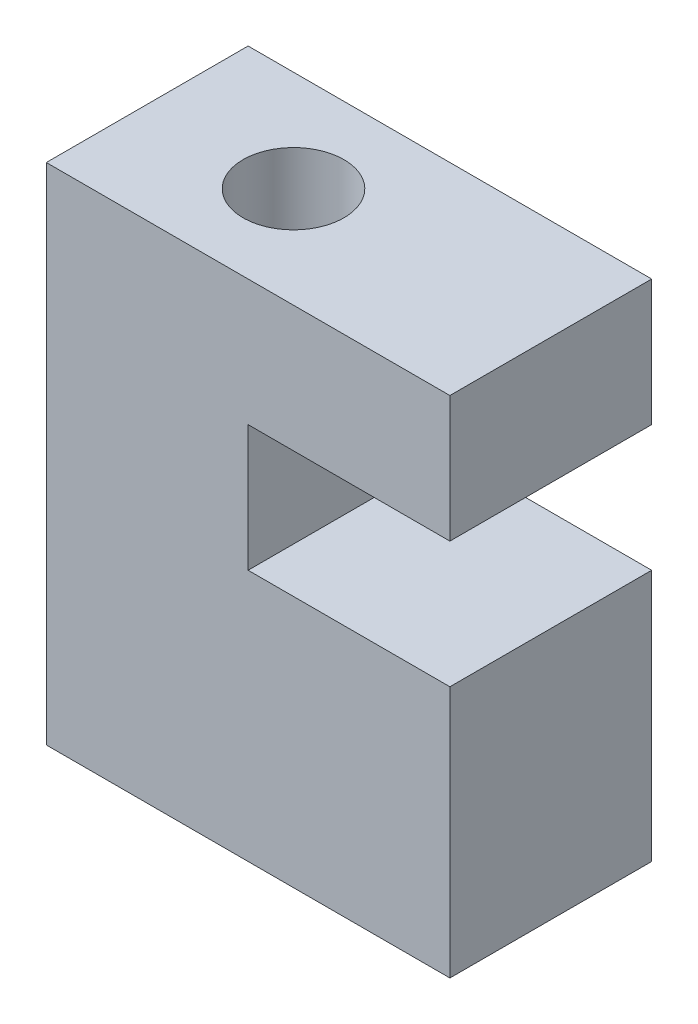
from build123d import *

# Parameters (mm, degrees)
LINEAR_AUSTRAGEN1_DEPTH         = 20
SKIZZE2_R                       = 10
SCHNITT_LINEAR_AUSTRAGEN1_DEPTH = 130.614813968


with BuildPart() as part:
    # Skizze1 → Linear austragen1 (new, symmetric)
    with BuildSketch(Plane.XY):
        Polygon((0, 0), (80, 0), (80, 50), (40, 50), (40, 75), (80, 75), (80, 100), (0, 100), align=None)
    extrude(amount=LINEAR_AUSTRAGEN1_DEPTH, both=True)

    # Skizze2 → Schnitt-Linear austragen1 (cut, through all)
    with BuildSketch(Plane(origin=(0, 100, 0), x_dir=(-1, 0, 0), z_dir=(0, 1, 0))):
        with Locations((-29, 0)):
            Circle(SKIZZE2_R)
    extrude(amount=-SCHNITT_LINEAR_AUSTRAGEN1_DEPTH, mode=Mode.SUBTRACT)


solid = part.part
